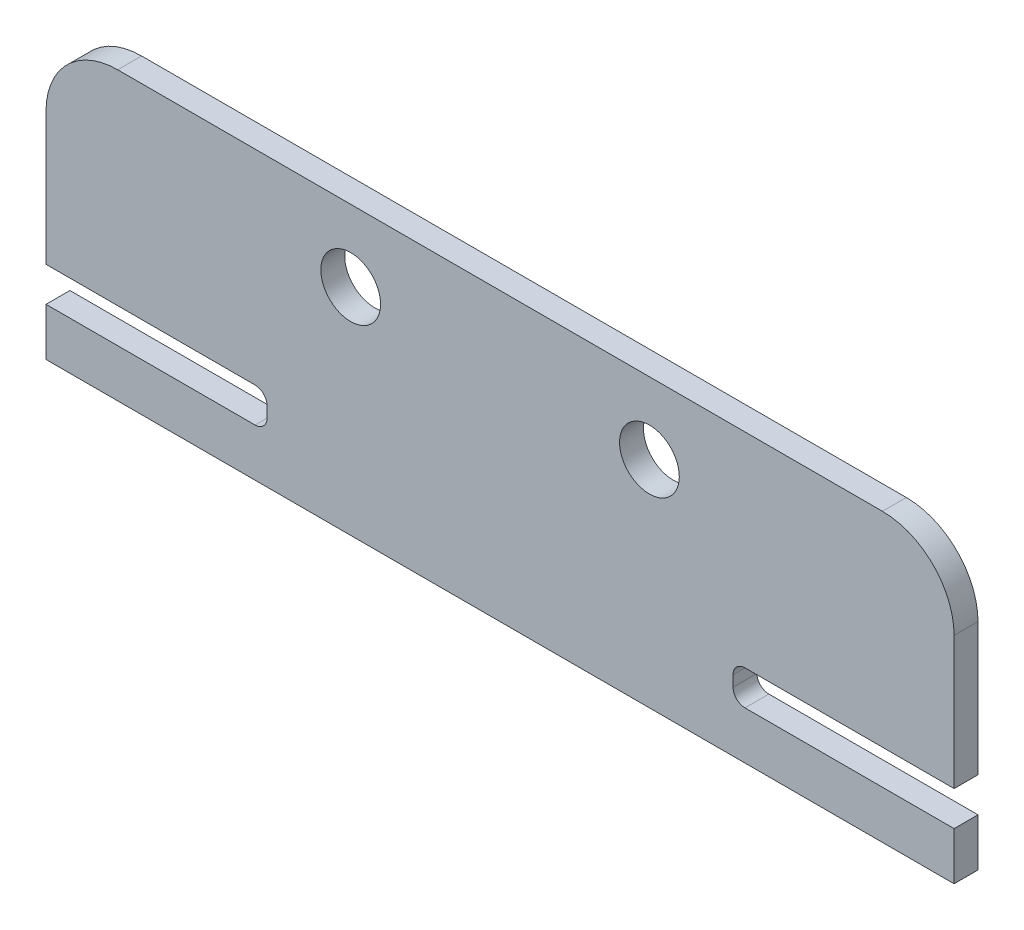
ISO-10303-21;
HEADER;
FILE_DESCRIPTION(('STEP AP214'),'2;1');
FILE_NAME('part.step','',(''),(''),'','','');
FILE_SCHEMA(('AUTOMOTIVE_DESIGN { 1 0 10303 214 1 1 1 1 }'));
ENDSEC;
DATA;
#1=APPLICATION_CONTEXT('core data for automotive mechanical design processes');
#2=APPLICATION_PROTOCOL_DEFINITION('international standard','automotive_design',2000,#1);
#3=PRODUCT_CONTEXT('',#1,'mechanical');
#4=PRODUCT('Part','Part','',(#3));
#5=PRODUCT_RELATED_PRODUCT_CATEGORY('part','',(#4));
#6=PRODUCT_DEFINITION_FORMATION('','',#4);
#7=PRODUCT_DEFINITION_CONTEXT('part definition',#1,'design');
#8=PRODUCT_DEFINITION('design','',#6,#7);
#9=PRODUCT_DEFINITION_SHAPE('','',#8);
#10=(LENGTH_UNIT() NAMED_UNIT(*) SI_UNIT(.MILLI.,.METRE.));
#11=(NAMED_UNIT(*) PLANE_ANGLE_UNIT() SI_UNIT($,.RADIAN.));
#12=(NAMED_UNIT(*) SI_UNIT($,.STERADIAN.) SOLID_ANGLE_UNIT());
#13=UNCERTAINTY_MEASURE_WITH_UNIT(LENGTH_MEASURE(1.E-05),#10,'distance_accuracy_value','');
#14=(GEOMETRIC_REPRESENTATION_CONTEXT(3) GLOBAL_UNCERTAINTY_ASSIGNED_CONTEXT((#13)) GLOBAL_UNIT_ASSIGNED_CONTEXT((#10,
#11,#12)) REPRESENTATION_CONTEXT('',''));
#15=CARTESIAN_POINT('',(0.,0.,0.));
#16=DIRECTION('',(0.,0.,1.));
#17=DIRECTION('',(1.,0.,0.));
#18=AXIS2_PLACEMENT_3D('',#15,#16,#17);
#19=CARTESIAN_POINT('',(-482.6,76.2000000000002,25.4));
#20=DIRECTION('',(0.,0.,1.));
#21=DIRECTION('',(1.,0.,0.));
#22=AXIS2_PLACEMENT_3D('',#19,#20,#21);
#23=PLANE('',#22);
#24=CARTESIAN_POINT('',(158.75,0.,25.4));
#25=DIRECTION('',(0.,0.,1.));
#26=DIRECTION('',(1.,0.,0.));
#27=AXIS2_PLACEMENT_3D('',#24,#25,#26);
#28=CIRCLE('',#27,31.75);
#29=CARTESIAN_POINT('',(190.5,0.,25.4));
#30=VERTEX_POINT('',#29);
#31=EDGE_CURVE('E170',#30,#30,#28,.T.);
#32=ORIENTED_EDGE('',*,*,#31,.F.);
#33=EDGE_LOOP('',(#32));
#34=FACE_BOUND('',#33,.T.);
#35=DIRECTION('',(0.,1.,0.));
#36=VECTOR('',#35,1.);
#37=CARTESIAN_POINT('',(482.6,76.2,25.4));
#38=LINE('',#37,#36);
#39=CARTESIAN_POINT('',(482.6,-140.97,25.4));
#40=VERTEX_POINT('',#39);
#41=CARTESIAN_POINT('',(482.6,0.,25.4));
#42=VERTEX_POINT('',#41);
#43=EDGE_CURVE('E272',#40,#42,#38,.T.);
#44=ORIENTED_EDGE('',*,*,#43,.T.);
#45=CARTESIAN_POINT('',(406.4,0.,25.4));
#46=DIRECTION('',(0.,0.,1.));
#47=DIRECTION('',(1.,0.,0.));
#48=AXIS2_PLACEMENT_3D('',#45,#46,#47);
#49=CIRCLE('',#48,76.2);
#50=CARTESIAN_POINT('',(406.4,76.2,25.4));
#51=VERTEX_POINT('',#50);
#52=EDGE_CURVE('E206',#42,#51,#49,.T.);
#53=ORIENTED_EDGE('',*,*,#52,.T.);
#54=DIRECTION('',(-1.,0.,0.));
#55=VECTOR('',#54,1.);
#56=CARTESIAN_POINT('',(279.4,76.2,25.4));
#57=LINE('',#56,#55);
#58=CARTESIAN_POINT('',(-406.4,76.2000000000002,25.4));
#59=VERTEX_POINT('',#58);
#60=EDGE_CURVE('E275',#51,#59,#57,.T.);
#61=ORIENTED_EDGE('',*,*,#60,.T.);
#62=CARTESIAN_POINT('',(-406.4,0.,25.4));
#63=DIRECTION('',(0.,0.,1.));
#64=DIRECTION('',(1.,0.,0.));
#65=AXIS2_PLACEMENT_3D('',#62,#63,#64);
#66=CIRCLE('',#65,76.2);
#67=CARTESIAN_POINT('',(-482.6,0.,25.4));
#68=VERTEX_POINT('',#67);
#69=EDGE_CURVE('E204',#59,#68,#66,.T.);
#70=ORIENTED_EDGE('',*,*,#69,.T.);
#71=DIRECTION('',(0.,-1.,0.));
#72=VECTOR('',#71,1.);
#73=CARTESIAN_POINT('',(-482.6,76.2,25.4));
#74=LINE('',#73,#72);
#75=CARTESIAN_POINT('',(-482.6,-140.97,25.4));
#76=VERTEX_POINT('',#75);
#77=EDGE_CURVE('E318',#68,#76,#74,.T.);
#78=ORIENTED_EDGE('',*,*,#77,.T.);
#79=DIRECTION('',(1.,0.,0.));
#80=VECTOR('',#79,1.);
#81=CARTESIAN_POINT('',(-482.6,-140.97,25.4));
#82=LINE('',#81,#80);
#83=CARTESIAN_POINT('',(-260.35,-140.97,25.4));
#84=VERTEX_POINT('',#83);
#85=EDGE_CURVE('E185',#76,#84,#82,.T.);
#86=ORIENTED_EDGE('',*,*,#85,.T.);
#87=CARTESIAN_POINT('',(-260.35,-153.67,25.4));
#88=DIRECTION('',(0.,0.,1.));
#89=DIRECTION('',(1.,0.,0.));
#90=AXIS2_PLACEMENT_3D('',#87,#88,#89);
#91=CIRCLE('',#90,12.7);
#92=CARTESIAN_POINT('',(-247.65,-153.67,25.4));
#93=VERTEX_POINT('',#92);
#94=EDGE_CURVE('E237',#84,#93,#91,.F.);
#95=ORIENTED_EDGE('',*,*,#94,.T.);
#96=DIRECTION('',(0.,-1.,0.));
#97=VECTOR('',#96,1.);
#98=CARTESIAN_POINT('',(-247.65,-140.97,25.4));
#99=LINE('',#98,#97);
#100=CARTESIAN_POINT('',(-247.65,-165.1,25.4));
#101=VERTEX_POINT('',#100);
#102=EDGE_CURVE('E254',#93,#101,#99,.T.);
#103=ORIENTED_EDGE('',*,*,#102,.T.);
#104=CARTESIAN_POINT('',(-260.35,-165.1,25.4));
#105=DIRECTION('',(0.,0.,1.));
#106=DIRECTION('',(1.,0.,0.));
#107=AXIS2_PLACEMENT_3D('',#104,#105,#106);
#108=CIRCLE('',#107,12.7);
#109=CARTESIAN_POINT('',(-260.35,-177.8,25.4));
#110=VERTEX_POINT('',#109);
#111=EDGE_CURVE('E11',#101,#110,#108,.F.);
#112=ORIENTED_EDGE('',*,*,#111,.T.);
#113=DIRECTION('',(-1.,0.,0.));
#114=VECTOR('',#113,1.);
#115=CARTESIAN_POINT('',(-482.6,-177.8,25.4));
#116=LINE('',#115,#114);
#117=CARTESIAN_POINT('',(-482.6,-177.8,25.4));
#118=VERTEX_POINT('',#117);
#119=EDGE_CURVE('E251',#110,#118,#116,.T.);
#120=ORIENTED_EDGE('',*,*,#119,.T.);
#121=DIRECTION('',(0.,-1.,0.));
#122=VECTOR('',#121,1.);
#123=CARTESIAN_POINT('',(-482.6,-177.8,25.4));
#124=LINE('',#123,#122);
#125=CARTESIAN_POINT('',(-482.6,-228.6,25.4));
#126=VERTEX_POINT('',#125);
#127=EDGE_CURVE('E253',#118,#126,#124,.T.);
#128=ORIENTED_EDGE('',*,*,#127,.T.);
#129=DIRECTION('',(1.,0.,0.));
#130=VECTOR('',#129,1.);
#131=CARTESIAN_POINT('',(-482.6,-228.6,25.4));
#132=LINE('',#131,#130);
#133=CARTESIAN_POINT('',(482.6,-228.6,25.4));
#134=VERTEX_POINT('',#133);
#135=EDGE_CURVE('E256',#126,#134,#132,.T.);
#136=ORIENTED_EDGE('',*,*,#135,.T.);
#137=DIRECTION('',(0.,1.,0.));
#138=VECTOR('',#137,1.);
#139=CARTESIAN_POINT('',(482.6,-177.8,25.4));
#140=LINE('',#139,#138);
#141=CARTESIAN_POINT('',(482.6,-177.8,25.4));
#142=VERTEX_POINT('',#141);
#143=EDGE_CURVE('E262',#134,#142,#140,.T.);
#144=ORIENTED_EDGE('',*,*,#143,.T.);
#145=DIRECTION('',(-1.,0.,0.));
#146=VECTOR('',#145,1.);
#147=CARTESIAN_POINT('',(247.65,-177.8,25.4));
#148=LINE('',#147,#146);
#149=CARTESIAN_POINT('',(260.35,-177.8,25.4));
#150=VERTEX_POINT('',#149);
#151=EDGE_CURVE('E264',#142,#150,#148,.T.);
#152=ORIENTED_EDGE('',*,*,#151,.T.);
#153=CARTESIAN_POINT('',(260.35,-165.1,25.4));
#154=DIRECTION('',(0.,0.,1.));
#155=DIRECTION('',(1.,0.,0.));
#156=AXIS2_PLACEMENT_3D('',#153,#154,#155);
#157=CIRCLE('',#156,12.7);
#158=CARTESIAN_POINT('',(247.65,-165.1,25.4));
#159=VERTEX_POINT('',#158);
#160=EDGE_CURVE('E234',#150,#159,#157,.F.);
#161=ORIENTED_EDGE('',*,*,#160,.T.);
#162=DIRECTION('',(0.,1.,0.));
#163=VECTOR('',#162,1.);
#164=CARTESIAN_POINT('',(247.65,-140.97,25.4));
#165=LINE('',#164,#163);
#166=CARTESIAN_POINT('',(247.65,-153.67,25.4));
#167=VERTEX_POINT('',#166);
#168=EDGE_CURVE('E267',#159,#167,#165,.T.);
#169=ORIENTED_EDGE('',*,*,#168,.T.);
#170=CARTESIAN_POINT('',(260.35,-153.67,25.4));
#171=DIRECTION('',(0.,0.,1.));
#172=DIRECTION('',(1.,0.,0.));
#173=AXIS2_PLACEMENT_3D('',#170,#171,#172);
#174=CIRCLE('',#173,12.7);
#175=CARTESIAN_POINT('',(260.35,-140.97,25.4));
#176=VERTEX_POINT('',#175);
#177=EDGE_CURVE('E230',#167,#176,#174,.F.);
#178=ORIENTED_EDGE('',*,*,#177,.T.);
#179=DIRECTION('',(1.,0.,0.));
#180=VECTOR('',#179,1.);
#181=CARTESIAN_POINT('',(482.6,-140.97,25.4));
#182=LINE('',#181,#180);
#183=EDGE_CURVE('E270',#176,#40,#182,.T.);
#184=ORIENTED_EDGE('',*,*,#183,.T.);
#185=EDGE_LOOP('',(#44,#53,#61,#70,#78,#86,#95,#103,#112,#120,#128,#136,#144,#152,#161,#169,
#178,#184));
#186=FACE_BOUND('',#185,.T.);
#187=CARTESIAN_POINT('',(-158.75,0.,25.4));
#188=DIRECTION('',(0.,0.,1.));
#189=DIRECTION('',(1.,0.,0.));
#190=AXIS2_PLACEMENT_3D('',#187,#188,#189);
#191=CIRCLE('',#190,31.75);
#192=CARTESIAN_POINT('',(-127.,0.,25.4));
#193=VERTEX_POINT('',#192);
#194=EDGE_CURVE('E547',#193,#193,#191,.T.);
#195=ORIENTED_EDGE('',*,*,#194,.F.);
#196=EDGE_LOOP('',(#195));
#197=FACE_BOUND('',#196,.T.);
#198=ADVANCED_FACE('F36',(#34,#186,#197),#23,.T.);
#199=CARTESIAN_POINT('',(-482.6,76.2000000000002,0.));
#200=DIRECTION('',(0.,0.,1.));
#201=DIRECTION('',(1.,0.,0.));
#202=AXIS2_PLACEMENT_3D('',#199,#200,#201);
#203=PLANE('',#202);
#204=CARTESIAN_POINT('',(158.75,0.,0.));
#205=DIRECTION('',(0.,0.,1.));
#206=DIRECTION('',(1.,0.,0.));
#207=AXIS2_PLACEMENT_3D('',#204,#205,#206);
#208=CIRCLE('',#207,31.75);
#209=CARTESIAN_POINT('',(190.5,0.,0.));
#210=VERTEX_POINT('',#209);
#211=EDGE_CURVE('E546',#210,#210,#208,.T.);
#212=ORIENTED_EDGE('',*,*,#211,.T.);
#213=EDGE_LOOP('',(#212));
#214=FACE_BOUND('',#213,.T.);
#215=DIRECTION('',(-1.,0.,0.));
#216=VECTOR('',#215,1.);
#217=CARTESIAN_POINT('',(-279.4,76.2,0.));
#218=LINE('',#217,#216);
#219=CARTESIAN_POINT('',(406.4,76.2,0.));
#220=VERTEX_POINT('',#219);
#221=CARTESIAN_POINT('',(-406.4,76.2,0.));
#222=VERTEX_POINT('',#221);
#223=EDGE_CURVE('E315',#220,#222,#218,.T.);
#224=ORIENTED_EDGE('',*,*,#223,.F.);
#225=CARTESIAN_POINT('',(406.4,0.,0.));
#226=DIRECTION('',(0.,0.,1.));
#227=DIRECTION('',(1.,0.,0.));
#228=AXIS2_PLACEMENT_3D('',#225,#226,#227);
#229=CIRCLE('',#228,76.2);
#230=CARTESIAN_POINT('',(482.6,0.,0.));
#231=VERTEX_POINT('',#230);
#232=EDGE_CURVE('E200',#220,#231,#229,.F.);
#233=ORIENTED_EDGE('',*,*,#232,.T.);
#234=DIRECTION('',(0.,1.,0.));
#235=VECTOR('',#234,1.);
#236=CARTESIAN_POINT('',(482.6,76.2,0.));
#237=LINE('',#236,#235);
#238=CARTESIAN_POINT('',(482.6,-140.97,0.));
#239=VERTEX_POINT('',#238);
#240=EDGE_CURVE('E312',#239,#231,#237,.T.);
#241=ORIENTED_EDGE('',*,*,#240,.F.);
#242=DIRECTION('',(1.,0.,0.));
#243=VECTOR('',#242,1.);
#244=CARTESIAN_POINT('',(482.6,-140.97,0.));
#245=LINE('',#244,#243);
#246=CARTESIAN_POINT('',(260.35,-140.97,0.));
#247=VERTEX_POINT('',#246);
#248=EDGE_CURVE('E310',#247,#239,#245,.T.);
#249=ORIENTED_EDGE('',*,*,#248,.F.);
#250=CARTESIAN_POINT('',(260.35,-153.67,0.));
#251=DIRECTION('',(0.,0.,1.));
#252=DIRECTION('',(1.,0.,0.));
#253=AXIS2_PLACEMENT_3D('',#250,#251,#252);
#254=CIRCLE('',#253,12.7);
#255=CARTESIAN_POINT('',(247.65,-153.67,0.));
#256=VERTEX_POINT('',#255);
#257=EDGE_CURVE('E228',#247,#256,#254,.T.);
#258=ORIENTED_EDGE('',*,*,#257,.T.);
#259=DIRECTION('',(0.,1.,0.));
#260=VECTOR('',#259,1.);
#261=CARTESIAN_POINT('',(247.65,-140.97,0.));
#262=LINE('',#261,#260);
#263=CARTESIAN_POINT('',(247.65,-165.1,0.));
#264=VERTEX_POINT('',#263);
#265=EDGE_CURVE('E307',#264,#256,#262,.T.);
#266=ORIENTED_EDGE('',*,*,#265,.F.);
#267=CARTESIAN_POINT('',(260.35,-165.1,0.));
#268=DIRECTION('',(0.,0.,1.));
#269=DIRECTION('',(1.,0.,0.));
#270=AXIS2_PLACEMENT_3D('',#267,#268,#269);
#271=CIRCLE('',#270,12.7);
#272=CARTESIAN_POINT('',(260.35,-177.8,0.));
#273=VERTEX_POINT('',#272);
#274=EDGE_CURVE('E232',#264,#273,#271,.T.);
#275=ORIENTED_EDGE('',*,*,#274,.T.);
#276=DIRECTION('',(-1.,0.,0.));
#277=VECTOR('',#276,1.);
#278=CARTESIAN_POINT('',(247.65,-177.8,0.));
#279=LINE('',#278,#277);
#280=CARTESIAN_POINT('',(482.6,-177.8,0.));
#281=VERTEX_POINT('',#280);
#282=EDGE_CURVE('E300',#281,#273,#279,.T.);
#283=ORIENTED_EDGE('',*,*,#282,.F.);
#284=DIRECTION('',(0.,1.,0.));
#285=VECTOR('',#284,1.);
#286=CARTESIAN_POINT('',(482.6,-177.8,0.));
#287=LINE('',#286,#285);
#288=CARTESIAN_POINT('',(482.6,-228.6,0.));
#289=VERTEX_POINT('',#288);
#290=EDGE_CURVE('E298',#289,#281,#287,.T.);
#291=ORIENTED_EDGE('',*,*,#290,.F.);
#292=DIRECTION('',(1.,0.,0.));
#293=VECTOR('',#292,1.);
#294=CARTESIAN_POINT('',(-482.6,-228.6,0.));
#295=LINE('',#294,#293);
#296=CARTESIAN_POINT('',(-482.6,-228.6,0.));
#297=VERTEX_POINT('',#296);
#298=EDGE_CURVE('E293',#297,#289,#295,.T.);
#299=ORIENTED_EDGE('',*,*,#298,.F.);
#300=DIRECTION('',(0.,-1.,0.));
#301=VECTOR('',#300,1.);
#302=CARTESIAN_POINT('',(-482.6,-177.8,0.));
#303=LINE('',#302,#301);
#304=CARTESIAN_POINT('',(-482.6,-177.8,0.));
#305=VERTEX_POINT('',#304);
#306=EDGE_CURVE('E296',#305,#297,#303,.T.);
#307=ORIENTED_EDGE('',*,*,#306,.F.);
#308=DIRECTION('',(-1.,0.,0.));
#309=VECTOR('',#308,1.);
#310=CARTESIAN_POINT('',(-482.6,-177.8,0.));
#311=LINE('',#310,#309);
#312=CARTESIAN_POINT('',(-260.35,-177.8,0.));
#313=VERTEX_POINT('',#312);
#314=EDGE_CURVE('E241',#313,#305,#311,.T.);
#315=ORIENTED_EDGE('',*,*,#314,.F.);
#316=CARTESIAN_POINT('',(-260.35,-165.1,0.));
#317=DIRECTION('',(0.,0.,1.));
#318=DIRECTION('',(1.,0.,0.));
#319=AXIS2_PLACEMENT_3D('',#316,#317,#318);
#320=CIRCLE('',#319,12.7);
#321=CARTESIAN_POINT('',(-247.65,-165.1,0.));
#322=VERTEX_POINT('',#321);
#323=EDGE_CURVE('E44',#313,#322,#320,.T.);
#324=ORIENTED_EDGE('',*,*,#323,.T.);
#325=DIRECTION('',(0.,-1.,0.));
#326=VECTOR('',#325,1.);
#327=CARTESIAN_POINT('',(-247.65,-140.97,0.));
#328=LINE('',#327,#326);
#329=CARTESIAN_POINT('',(-247.65,-153.67,0.));
#330=VERTEX_POINT('',#329);
#331=EDGE_CURVE('E180',#330,#322,#328,.T.);
#332=ORIENTED_EDGE('',*,*,#331,.F.);
#333=CARTESIAN_POINT('',(-260.35,-153.67,0.));
#334=DIRECTION('',(0.,0.,1.));
#335=DIRECTION('',(1.,0.,0.));
#336=AXIS2_PLACEMENT_3D('',#333,#334,#335);
#337=CIRCLE('',#336,12.7);
#338=CARTESIAN_POINT('',(-260.35,-140.97,0.));
#339=VERTEX_POINT('',#338);
#340=EDGE_CURVE('E177',#330,#339,#337,.T.);
#341=ORIENTED_EDGE('',*,*,#340,.T.);
#342=DIRECTION('',(1.,0.,0.));
#343=VECTOR('',#342,1.);
#344=CARTESIAN_POINT('',(-482.6,-140.97,0.));
#345=LINE('',#344,#343);
#346=CARTESIAN_POINT('',(-482.6,-140.97,0.));
#347=VERTEX_POINT('',#346);
#348=EDGE_CURVE('E169',#347,#339,#345,.T.);
#349=ORIENTED_EDGE('',*,*,#348,.F.);
#350=DIRECTION('',(0.,-1.,0.));
#351=VECTOR('',#350,1.);
#352=CARTESIAN_POINT('',(-482.6,76.2,0.));
#353=LINE('',#352,#351);
#354=CARTESIAN_POINT('',(-482.6,0.,0.));
#355=VERTEX_POINT('',#354);
#356=EDGE_CURVE('E161',#355,#347,#353,.T.);
#357=ORIENTED_EDGE('',*,*,#356,.F.);
#358=CARTESIAN_POINT('',(-406.4,0.,0.));
#359=DIRECTION('',(0.,0.,1.));
#360=DIRECTION('',(1.,0.,0.));
#361=AXIS2_PLACEMENT_3D('',#358,#359,#360);
#362=CIRCLE('',#361,76.2);
#363=EDGE_CURVE('E198',#355,#222,#362,.F.);
#364=ORIENTED_EDGE('',*,*,#363,.T.);
#365=EDGE_LOOP('',(#224,#233,#241,#249,#258,#266,#275,#283,#291,#299,#307,#315,#324,#332,#341,
#349,#357,#364));
#366=FACE_BOUND('',#365,.T.);
#367=CARTESIAN_POINT('',(-158.75,0.,0.));
#368=DIRECTION('',(0.,0.,1.));
#369=DIRECTION('',(1.,0.,0.));
#370=AXIS2_PLACEMENT_3D('',#367,#368,#369);
#371=CIRCLE('',#370,31.75);
#372=CARTESIAN_POINT('',(-127.,0.,0.));
#373=VERTEX_POINT('',#372);
#374=EDGE_CURVE('E551',#373,#373,#371,.T.);
#375=ORIENTED_EDGE('',*,*,#374,.T.);
#376=EDGE_LOOP('',(#375));
#377=FACE_BOUND('',#376,.T.);
#378=ADVANCED_FACE('F174',(#214,#366,#377),#203,.F.);
#379=CARTESIAN_POINT('',(-482.6,76.2,25.4));
#380=DIRECTION('',(1.,0.,0.));
#381=DIRECTION('',(0.,1.,0.));
#382=AXIS2_PLACEMENT_3D('',#379,#380,#381);
#383=PLANE('',#382);
#384=ORIENTED_EDGE('',*,*,#77,.F.);
#385=DIRECTION('',(0.,0.,-1.));
#386=VECTOR('',#385,1.);
#387=CARTESIAN_POINT('',(-482.6,0.,25.4));
#388=LINE('',#387,#386);
#389=EDGE_CURVE('E167',#68,#355,#388,.T.);
#390=ORIENTED_EDGE('',*,*,#389,.T.);
#391=ORIENTED_EDGE('',*,*,#356,.T.);
#392=DIRECTION('',(0.,0.,-1.));
#393=VECTOR('',#392,1.);
#394=CARTESIAN_POINT('',(-482.6,-140.97,25.4));
#395=LINE('',#394,#393);
#396=EDGE_CURVE('E165',#76,#347,#395,.T.);
#397=ORIENTED_EDGE('',*,*,#396,.F.);
#398=EDGE_LOOP('',(#384,#390,#391,#397));
#399=FACE_BOUND('',#398,.T.);
#400=ADVANCED_FACE('F38',(#399),#383,.F.);
#401=CARTESIAN_POINT('',(-482.6,-140.97,25.4));
#402=DIRECTION('',(0.,1.,0.));
#403=DIRECTION('',(0.,0.,1.));
#404=AXIS2_PLACEMENT_3D('',#401,#402,#403);
#405=PLANE('',#404);
#406=ORIENTED_EDGE('',*,*,#348,.T.);
#407=DIRECTION('',(0.,0.,-1.));
#408=VECTOR('',#407,1.);
#409=CARTESIAN_POINT('',(-260.35,-140.97,25.4));
#410=LINE('',#409,#408);
#411=EDGE_CURVE('E224',#339,#84,#410,.F.);
#412=ORIENTED_EDGE('',*,*,#411,.T.);
#413=ORIENTED_EDGE('',*,*,#85,.F.);
#414=ORIENTED_EDGE('',*,*,#396,.T.);
#415=EDGE_LOOP('',(#406,#412,#413,#414));
#416=FACE_BOUND('',#415,.T.);
#417=ADVANCED_FACE('F183',(#416),#405,.F.);
#418=CARTESIAN_POINT('',(-247.65,-140.97,25.4));
#419=DIRECTION('',(1.,0.,0.));
#420=DIRECTION('',(0.,0.,-1.));
#421=AXIS2_PLACEMENT_3D('',#418,#419,#420);
#422=PLANE('',#421);
#423=ORIENTED_EDGE('',*,*,#102,.F.);
#424=DIRECTION('',(0.,0.,-1.));
#425=VECTOR('',#424,1.);
#426=CARTESIAN_POINT('',(-247.65,-153.67,0.));
#427=LINE('',#426,#425);
#428=EDGE_CURVE('E221',#93,#330,#427,.T.);
#429=ORIENTED_EDGE('',*,*,#428,.T.);
#430=ORIENTED_EDGE('',*,*,#331,.T.);
#431=DIRECTION('',(0.,0.,-1.));
#432=VECTOR('',#431,1.);
#433=CARTESIAN_POINT('',(-247.65,-165.1,25.4));
#434=LINE('',#433,#432);
#435=EDGE_CURVE('E219',#322,#101,#434,.F.);
#436=ORIENTED_EDGE('',*,*,#435,.T.);
#437=EDGE_LOOP('',(#423,#429,#430,#436));
#438=FACE_BOUND('',#437,.T.);
#439=ADVANCED_FACE('F244',(#438),#422,.F.);
#440=CARTESIAN_POINT('',(-482.6,-177.8,25.4));
#441=DIRECTION('',(0.,-1.,0.));
#442=DIRECTION('',(1.,0.,0.));
#443=AXIS2_PLACEMENT_3D('',#440,#441,#442);
#444=PLANE('',#443);
#445=ORIENTED_EDGE('',*,*,#119,.F.);
#446=DIRECTION('',(0.,0.,-1.));
#447=VECTOR('',#446,1.);
#448=CARTESIAN_POINT('',(-260.35,-177.8,0.));
#449=LINE('',#448,#447);
#450=EDGE_CURVE('E226',#110,#313,#449,.T.);
#451=ORIENTED_EDGE('',*,*,#450,.T.);
#452=ORIENTED_EDGE('',*,*,#314,.T.);
#453=DIRECTION('',(0.,0.,-1.));
#454=VECTOR('',#453,1.);
#455=CARTESIAN_POINT('',(-482.6,-177.8,25.4));
#456=LINE('',#455,#454);
#457=EDGE_CURVE('E187',#118,#305,#456,.T.);
#458=ORIENTED_EDGE('',*,*,#457,.F.);
#459=EDGE_LOOP('',(#445,#451,#452,#458));
#460=FACE_BOUND('',#459,.T.);
#461=ADVANCED_FACE('F249',(#460),#444,.F.);
#462=CARTESIAN_POINT('',(-482.6,-177.8,25.4));
#463=DIRECTION('',(1.,0.,0.));
#464=DIRECTION('',(0.,0.,-1.));
#465=AXIS2_PLACEMENT_3D('',#462,#463,#464);
#466=PLANE('',#465);
#467=ORIENTED_EDGE('',*,*,#306,.T.);
#468=DIRECTION('',(0.,0.,-1.));
#469=VECTOR('',#468,1.);
#470=CARTESIAN_POINT('',(-482.6,-228.6,25.4));
#471=LINE('',#470,#469);
#472=EDGE_CURVE('E192',#126,#297,#471,.T.);
#473=ORIENTED_EDGE('',*,*,#472,.F.);
#474=ORIENTED_EDGE('',*,*,#127,.F.);
#475=ORIENTED_EDGE('',*,*,#457,.T.);
#476=EDGE_LOOP('',(#467,#473,#474,#475));
#477=FACE_BOUND('',#476,.T.);
#478=ADVANCED_FACE('F372',(#477),#466,.F.);
#479=CARTESIAN_POINT('',(-482.6,-228.6,25.4));
#480=DIRECTION('',(0.,1.,0.));
#481=DIRECTION('',(0.,0.,1.));
#482=AXIS2_PLACEMENT_3D('',#479,#480,#481);
#483=PLANE('',#482);
#484=ORIENTED_EDGE('',*,*,#298,.T.);
#485=DIRECTION('',(0.,0.,-1.));
#486=VECTOR('',#485,1.);
#487=CARTESIAN_POINT('',(482.6,-228.6,25.4));
#488=LINE('',#487,#486);
#489=EDGE_CURVE('E284',#134,#289,#488,.T.);
#490=ORIENTED_EDGE('',*,*,#489,.F.);
#491=ORIENTED_EDGE('',*,*,#135,.F.);
#492=ORIENTED_EDGE('',*,*,#472,.T.);
#493=EDGE_LOOP('',(#484,#490,#491,#492));
#494=FACE_BOUND('',#493,.T.);
#495=ADVANCED_FACE('F291',(#494),#483,.F.);
#496=CARTESIAN_POINT('',(482.6,-177.8,25.4));
#497=DIRECTION('',(-1.,0.,0.));
#498=DIRECTION('',(0.,0.,1.));
#499=AXIS2_PLACEMENT_3D('',#496,#497,#498);
#500=PLANE('',#499);
#501=ORIENTED_EDGE('',*,*,#290,.T.);
#502=DIRECTION('',(0.,0.,-1.));
#503=VECTOR('',#502,1.);
#504=CARTESIAN_POINT('',(482.6,-177.8,25.4));
#505=LINE('',#504,#503);
#506=EDGE_CURVE('E281',#142,#281,#505,.T.);
#507=ORIENTED_EDGE('',*,*,#506,.F.);
#508=ORIENTED_EDGE('',*,*,#143,.F.);
#509=ORIENTED_EDGE('',*,*,#489,.T.);
#510=EDGE_LOOP('',(#501,#507,#508,#509));
#511=FACE_BOUND('',#510,.T.);
#512=ADVANCED_FACE('F365',(#511),#500,.F.);
#513=CARTESIAN_POINT('',(247.65,-177.8,25.4));
#514=DIRECTION('',(0.,-1.,0.));
#515=DIRECTION('',(0.,0.,-1.));
#516=AXIS2_PLACEMENT_3D('',#513,#514,#515);
#517=PLANE('',#516);
#518=ORIENTED_EDGE('',*,*,#282,.T.);
#519=DIRECTION('',(0.,0.,-1.));
#520=VECTOR('',#519,1.);
#521=CARTESIAN_POINT('',(260.35,-177.8,25.4));
#522=LINE('',#521,#520);
#523=EDGE_CURVE('E217',#273,#150,#522,.F.);
#524=ORIENTED_EDGE('',*,*,#523,.T.);
#525=ORIENTED_EDGE('',*,*,#151,.F.);
#526=ORIENTED_EDGE('',*,*,#506,.T.);
#527=EDGE_LOOP('',(#518,#524,#525,#526));
#528=FACE_BOUND('',#527,.T.);
#529=ADVANCED_FACE('F361',(#528),#517,.F.);
#530=CARTESIAN_POINT('',(247.65,-140.97,25.4));
#531=DIRECTION('',(-1.,0.,0.));
#532=DIRECTION('',(0.,0.,1.));
#533=AXIS2_PLACEMENT_3D('',#530,#531,#532);
#534=PLANE('',#533);
#535=ORIENTED_EDGE('',*,*,#265,.T.);
#536=DIRECTION('',(0.,0.,-1.));
#537=VECTOR('',#536,1.);
#538=CARTESIAN_POINT('',(247.65,-153.67,25.4));
#539=LINE('',#538,#537);
#540=EDGE_CURVE('E215',#256,#167,#539,.F.);
#541=ORIENTED_EDGE('',*,*,#540,.T.);
#542=ORIENTED_EDGE('',*,*,#168,.F.);
#543=DIRECTION('',(0.,0.,-1.));
#544=VECTOR('',#543,1.);
#545=CARTESIAN_POINT('',(247.65,-165.1,0.));
#546=LINE('',#545,#544);
#547=EDGE_CURVE('E212',#159,#264,#546,.T.);
#548=ORIENTED_EDGE('',*,*,#547,.T.);
#549=EDGE_LOOP('',(#535,#541,#542,#548));
#550=FACE_BOUND('',#549,.T.);
#551=ADVANCED_FACE('F357',(#550),#534,.F.);
#552=CARTESIAN_POINT('',(482.6,-140.97,25.4));
#553=DIRECTION('',(0.,1.,0.));
#554=DIRECTION('',(-1.,0.,0.));
#555=AXIS2_PLACEMENT_3D('',#552,#553,#554);
#556=PLANE('',#555);
#557=ORIENTED_EDGE('',*,*,#183,.F.);
#558=DIRECTION('',(0.,0.,-1.));
#559=VECTOR('',#558,1.);
#560=CARTESIAN_POINT('',(260.35,-140.97,0.));
#561=LINE('',#560,#559);
#562=EDGE_CURVE('E209',#176,#247,#561,.T.);
#563=ORIENTED_EDGE('',*,*,#562,.T.);
#564=ORIENTED_EDGE('',*,*,#248,.T.);
#565=DIRECTION('',(0.,0.,-1.));
#566=VECTOR('',#565,1.);
#567=CARTESIAN_POINT('',(482.6,-140.97,25.4));
#568=LINE('',#567,#566);
#569=EDGE_CURVE('E278',#40,#239,#568,.T.);
#570=ORIENTED_EDGE('',*,*,#569,.F.);
#571=EDGE_LOOP('',(#557,#563,#564,#570));
#572=FACE_BOUND('',#571,.T.);
#573=ADVANCED_FACE('F353',(#572),#556,.F.);
#574=CARTESIAN_POINT('',(482.6,76.2,25.4));
#575=DIRECTION('',(-1.,0.,0.));
#576=DIRECTION('',(0.,-1.,0.));
#577=AXIS2_PLACEMENT_3D('',#574,#575,#576);
#578=PLANE('',#577);
#579=ORIENTED_EDGE('',*,*,#240,.T.);
#580=DIRECTION('',(0.,0.,-1.));
#581=VECTOR('',#580,1.);
#582=CARTESIAN_POINT('',(482.6,0.,25.4));
#583=LINE('',#582,#581);
#584=EDGE_CURVE('E202',#231,#42,#583,.F.);
#585=ORIENTED_EDGE('',*,*,#584,.T.);
#586=ORIENTED_EDGE('',*,*,#43,.F.);
#587=ORIENTED_EDGE('',*,*,#569,.T.);
#588=EDGE_LOOP('',(#579,#585,#586,#587));
#589=FACE_BOUND('',#588,.T.);
#590=ADVANCED_FACE('F349',(#589),#578,.F.);
#591=CARTESIAN_POINT('',(-279.4,76.2,25.4));
#592=DIRECTION('',(0.,-1.,0.));
#593=DIRECTION('',(0.,0.,-1.));
#594=AXIS2_PLACEMENT_3D('',#591,#592,#593);
#595=PLANE('',#594);
#596=ORIENTED_EDGE('',*,*,#60,.F.);
#597=DIRECTION('',(0.,0.,-1.));
#598=VECTOR('',#597,1.);
#599=CARTESIAN_POINT('',(406.4,76.2,25.4));
#600=LINE('',#599,#598);
#601=EDGE_CURVE('E189',#51,#220,#600,.T.);
#602=ORIENTED_EDGE('',*,*,#601,.T.);
#603=ORIENTED_EDGE('',*,*,#223,.T.);
#604=DIRECTION('',(0.,0.,-1.));
#605=VECTOR('',#604,1.);
#606=CARTESIAN_POINT('',(-406.4,76.2,25.4));
#607=LINE('',#606,#605);
#608=EDGE_CURVE('E186',#222,#59,#607,.F.);
#609=ORIENTED_EDGE('',*,*,#608,.T.);
#610=EDGE_LOOP('',(#596,#602,#603,#609));
#611=FACE_BOUND('',#610,.T.);
#612=ADVANCED_FACE('F345',(#611),#595,.F.);
#613=CARTESIAN_POINT('',(158.75,0.,25.4));
#614=DIRECTION('',(0.,0.,-1.));
#615=DIRECTION('',(-1.,0.,0.));
#616=AXIS2_PLACEMENT_3D('',#613,#614,#615);
#617=CYLINDRICAL_SURFACE('',#616,31.75);
#618=ORIENTED_EDGE('',*,*,#31,.T.);
#619=EDGE_LOOP('',(#618));
#620=FACE_BOUND('',#619,.T.);
#621=ORIENTED_EDGE('',*,*,#211,.F.);
#622=EDGE_LOOP('',(#621));
#623=FACE_BOUND('',#622,.T.);
#624=ADVANCED_FACE('F348',(#620,#623),#617,.F.);
#625=CARTESIAN_POINT('',(-158.75,0.,25.4));
#626=DIRECTION('',(0.,0.,-1.));
#627=DIRECTION('',(-1.,0.,0.));
#628=AXIS2_PLACEMENT_3D('',#625,#626,#627);
#629=CYLINDRICAL_SURFACE('',#628,31.75);
#630=ORIENTED_EDGE('',*,*,#194,.T.);
#631=EDGE_LOOP('',(#630));
#632=FACE_BOUND('',#631,.T.);
#633=ORIENTED_EDGE('',*,*,#374,.F.);
#634=EDGE_LOOP('',(#633));
#635=FACE_BOUND('',#634,.T.);
#636=ADVANCED_FACE('F486',(#632,#635),#629,.F.);
#637=CARTESIAN_POINT('',(406.4,0.,25.4));
#638=DIRECTION('',(0.,0.,-1.));
#639=DIRECTION('',(-1.,0.,0.));
#640=AXIS2_PLACEMENT_3D('',#637,#638,#639);
#641=CYLINDRICAL_SURFACE('',#640,76.2);
#642=ORIENTED_EDGE('',*,*,#52,.F.);
#643=ORIENTED_EDGE('',*,*,#584,.F.);
#644=ORIENTED_EDGE('',*,*,#232,.F.);
#645=ORIENTED_EDGE('',*,*,#601,.F.);
#646=EDGE_LOOP('',(#642,#643,#644,#645));
#647=FACE_BOUND('',#646,.T.);
#648=ADVANCED_FACE('F479',(#647),#641,.T.);
#649=CARTESIAN_POINT('',(-406.4,0.,25.4));
#650=DIRECTION('',(0.,0.,-1.));
#651=DIRECTION('',(-1.,0.,0.));
#652=AXIS2_PLACEMENT_3D('',#649,#650,#651);
#653=CYLINDRICAL_SURFACE('',#652,76.2);
#654=ORIENTED_EDGE('',*,*,#69,.F.);
#655=ORIENTED_EDGE('',*,*,#608,.F.);
#656=ORIENTED_EDGE('',*,*,#363,.F.);
#657=ORIENTED_EDGE('',*,*,#389,.F.);
#658=EDGE_LOOP('',(#654,#655,#656,#657));
#659=FACE_BOUND('',#658,.T.);
#660=ADVANCED_FACE('F454',(#659),#653,.T.);
#661=CARTESIAN_POINT('',(260.35,-153.67,25.4));
#662=DIRECTION('',(0.,0.,1.));
#663=DIRECTION('',(1.,0.,0.));
#664=AXIS2_PLACEMENT_3D('',#661,#662,#663);
#665=CYLINDRICAL_SURFACE('',#664,12.7);
#666=ORIENTED_EDGE('',*,*,#177,.F.);
#667=ORIENTED_EDGE('',*,*,#540,.F.);
#668=ORIENTED_EDGE('',*,*,#257,.F.);
#669=ORIENTED_EDGE('',*,*,#562,.F.);
#670=EDGE_LOOP('',(#666,#667,#668,#669));
#671=FACE_BOUND('',#670,.T.);
#672=ADVANCED_FACE('F331',(#671),#665,.F.);
#673=CARTESIAN_POINT('',(260.35,-165.1,25.4));
#674=DIRECTION('',(0.,0.,1.));
#675=DIRECTION('',(1.,0.,0.));
#676=AXIS2_PLACEMENT_3D('',#673,#674,#675);
#677=CYLINDRICAL_SURFACE('',#676,12.7);
#678=ORIENTED_EDGE('',*,*,#160,.F.);
#679=ORIENTED_EDGE('',*,*,#523,.F.);
#680=ORIENTED_EDGE('',*,*,#274,.F.);
#681=ORIENTED_EDGE('',*,*,#547,.F.);
#682=EDGE_LOOP('',(#678,#679,#680,#681));
#683=FACE_BOUND('',#682,.T.);
#684=ADVANCED_FACE('F324',(#683),#677,.F.);
#685=CARTESIAN_POINT('',(-260.35,-153.67,25.4));
#686=DIRECTION('',(0.,0.,1.));
#687=DIRECTION('',(1.,0.,0.));
#688=AXIS2_PLACEMENT_3D('',#685,#686,#687);
#689=CYLINDRICAL_SURFACE('',#688,12.7);
#690=ORIENTED_EDGE('',*,*,#94,.F.);
#691=ORIENTED_EDGE('',*,*,#411,.F.);
#692=ORIENTED_EDGE('',*,*,#340,.F.);
#693=ORIENTED_EDGE('',*,*,#428,.F.);
#694=EDGE_LOOP('',(#690,#691,#692,#693));
#695=FACE_BOUND('',#694,.T.);
#696=ADVANCED_FACE('F322',(#695),#689,.F.);
#697=CARTESIAN_POINT('',(-260.35,-165.1,25.4));
#698=DIRECTION('',(0.,0.,1.));
#699=DIRECTION('',(1.,0.,0.));
#700=AXIS2_PLACEMENT_3D('',#697,#698,#699);
#701=CYLINDRICAL_SURFACE('',#700,12.7);
#702=ORIENTED_EDGE('',*,*,#111,.F.);
#703=ORIENTED_EDGE('',*,*,#435,.F.);
#704=ORIENTED_EDGE('',*,*,#323,.F.);
#705=ORIENTED_EDGE('',*,*,#450,.F.);
#706=EDGE_LOOP('',(#702,#703,#704,#705));
#707=FACE_BOUND('',#706,.T.);
#708=ADVANCED_FACE('F247',(#707),#701,.F.);
#709=CLOSED_SHELL('',(#198,#378,#400,#417,#439,#461,#478,#495,#512,#529,#551,#573,#590,#612,
#624,#636,#648,#660,#672,#684,#696,#708));
#710=MANIFOLD_SOLID_BREP('B2',#709);
#711=ADVANCED_BREP_SHAPE_REPRESENTATION('',(#18,#710),#14);
#712=SHAPE_DEFINITION_REPRESENTATION(#9,#711);
ENDSEC;
END-ISO-10303-21;
